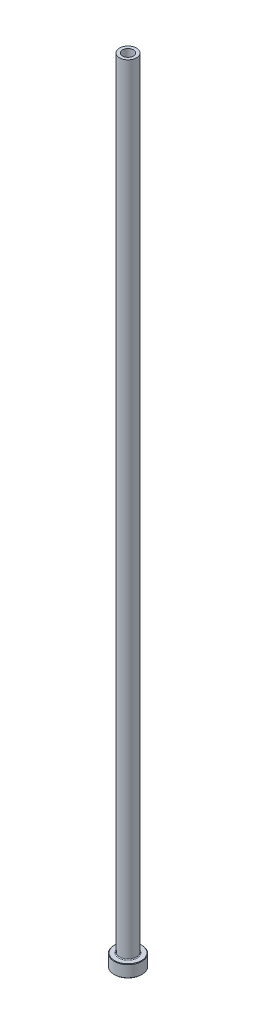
ISO-10303-21;
HEADER;
FILE_DESCRIPTION(('STEP AP214'),'2;1');
FILE_NAME('part.step','',(''),(''),'','','');
FILE_SCHEMA(('AUTOMOTIVE_DESIGN { 1 0 10303 214 1 1 1 1 }'));
ENDSEC;
DATA;
#1=APPLICATION_CONTEXT('core data for automotive mechanical design processes');
#2=APPLICATION_PROTOCOL_DEFINITION('international standard','automotive_design',2000,#1);
#3=PRODUCT_CONTEXT('',#1,'mechanical');
#4=PRODUCT('Part','Part','',(#3));
#5=PRODUCT_RELATED_PRODUCT_CATEGORY('part','',(#4));
#6=PRODUCT_DEFINITION_FORMATION('','',#4);
#7=PRODUCT_DEFINITION_CONTEXT('part definition',#1,'design');
#8=PRODUCT_DEFINITION('design','',#6,#7);
#9=PRODUCT_DEFINITION_SHAPE('','',#8);
#10=(LENGTH_UNIT() NAMED_UNIT(*) SI_UNIT(.MILLI.,.METRE.));
#11=(NAMED_UNIT(*) PLANE_ANGLE_UNIT() SI_UNIT($,.RADIAN.));
#12=(NAMED_UNIT(*) SI_UNIT($,.STERADIAN.) SOLID_ANGLE_UNIT());
#13=UNCERTAINTY_MEASURE_WITH_UNIT(LENGTH_MEASURE(1.E-05),#10,'distance_accuracy_value','');
#14=(GEOMETRIC_REPRESENTATION_CONTEXT(3) GLOBAL_UNCERTAINTY_ASSIGNED_CONTEXT((#13)) GLOBAL_UNIT_ASSIGNED_CONTEXT((#10,
#11,#12)) REPRESENTATION_CONTEXT('',''));
#15=CARTESIAN_POINT('',(0.,0.,0.));
#16=DIRECTION('',(0.,0.,1.));
#17=DIRECTION('',(1.,0.,0.));
#18=AXIS2_PLACEMENT_3D('',#15,#16,#17);
#19=CARTESIAN_POINT('',(0.,0.,0.));
#20=DIRECTION('',(0.,-1.,0.));
#21=DIRECTION('',(0.,0.,-1.));
#22=AXIS2_PLACEMENT_3D('',#19,#20,#21);
#23=PLANE('',#22);
#24=CARTESIAN_POINT('',(0.,0.,0.));
#25=DIRECTION('',(0.,-1.,0.));
#26=DIRECTION('',(0.,0.,-1.));
#27=AXIS2_PLACEMENT_3D('',#24,#25,#26);
#28=CIRCLE('',#27,6.88340000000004);
#29=CARTESIAN_POINT('',(0.,0.,-6.88340000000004));
#30=VERTEX_POINT('',#29);
#31=EDGE_CURVE('E45',#30,#30,#28,.T.);
#32=ORIENTED_EDGE('',*,*,#31,.T.);
#33=EDGE_LOOP('',(#32));
#34=FACE_BOUND('',#33,.T.);
#35=CARTESIAN_POINT('',(0.,0.,0.));
#36=DIRECTION('',(0.,-1.,0.));
#37=DIRECTION('',(0.,0.,-1.));
#38=AXIS2_PLACEMENT_3D('',#35,#36,#37);
#39=CIRCLE('',#38,3.36550000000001);
#40=CARTESIAN_POINT('',(0.,0.,-3.36550000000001));
#41=VERTEX_POINT('',#40);
#42=EDGE_CURVE('E59',#41,#41,#39,.T.);
#43=ORIENTED_EDGE('',*,*,#42,.F.);
#44=EDGE_LOOP('',(#43));
#45=FACE_BOUND('',#44,.T.);
#46=ADVANCED_FACE('F30',(#34,#45),#23,.T.);
#47=CARTESIAN_POINT('',(0.,0.,0.));
#48=DIRECTION('',(0.,-1.,0.));
#49=DIRECTION('',(0.,0.,-1.));
#50=AXIS2_PLACEMENT_3D('',#47,#48,#49);
#51=CYLINDRICAL_SURFACE('',#50,7.1374);
#52=CARTESIAN_POINT('',(0.,0.25399999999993,0.));
#53=DIRECTION('',(0.,-1.,0.));
#54=DIRECTION('',(0.,0.,-1.));
#55=AXIS2_PLACEMENT_3D('',#52,#53,#54);
#56=CIRCLE('',#55,7.1374);
#57=CARTESIAN_POINT('',(0.,0.25399999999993,-7.1374));
#58=VERTEX_POINT('',#57);
#59=EDGE_CURVE('E37',#58,#58,#56,.F.);
#60=ORIENTED_EDGE('',*,*,#59,.T.);
#61=EDGE_LOOP('',(#60));
#62=FACE_BOUND('',#61,.T.);
#63=CARTESIAN_POINT('',(0.,6.0959999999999,0.));
#64=DIRECTION('',(0.,1.,0.));
#65=DIRECTION('',(0.,0.,1.));
#66=AXIS2_PLACEMENT_3D('',#63,#64,#65);
#67=CIRCLE('',#66,7.1374);
#68=CARTESIAN_POINT('',(0.,6.0959999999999,7.1374));
#69=VERTEX_POINT('',#68);
#70=EDGE_CURVE('E41',#69,#69,#67,.F.);
#71=ORIENTED_EDGE('',*,*,#70,.T.);
#72=EDGE_LOOP('',(#71));
#73=FACE_BOUND('',#72,.T.);
#74=ADVANCED_FACE('F104',(#62,#73),#51,.T.);
#75=CARTESIAN_POINT('',(7.1374,6.35,0.));
#76=DIRECTION('',(0.,1.,0.));
#77=DIRECTION('',(0.,0.,1.));
#78=AXIS2_PLACEMENT_3D('',#75,#76,#77);
#79=PLANE('',#78);
#80=CARTESIAN_POINT('',(0.,6.35,0.));
#81=DIRECTION('',(0.,1.,0.));
#82=DIRECTION('',(0.,0.,1.));
#83=AXIS2_PLACEMENT_3D('',#80,#81,#82);
#84=CIRCLE('',#83,6.88339999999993);
#85=CARTESIAN_POINT('',(0.,6.35,6.88339999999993));
#86=VERTEX_POINT('',#85);
#87=EDGE_CURVE('E10',#86,#86,#84,.T.);
#88=ORIENTED_EDGE('',*,*,#87,.T.);
#89=EDGE_LOOP('',(#88));
#90=FACE_BOUND('',#89,.T.);
#91=CARTESIAN_POINT('',(0.,6.35,0.));
#92=DIRECTION('',(0.,-1.,0.));
#93=DIRECTION('',(0.,0.,-1.));
#94=AXIS2_PLACEMENT_3D('',#91,#92,#93);
#95=CIRCLE('',#94,4.755515);
#96=CARTESIAN_POINT('',(0.,6.35,-4.755515));
#97=VERTEX_POINT('',#96);
#98=EDGE_CURVE('E50',#97,#97,#95,.T.);
#99=ORIENTED_EDGE('',*,*,#98,.T.);
#100=EDGE_LOOP('',(#99));
#101=FACE_BOUND('',#100,.T.);
#102=ADVANCED_FACE('F110',(#90,#101),#79,.T.);
#103=CARTESIAN_POINT('',(0.,6.746875,0.));
#104=DIRECTION('',(0.,-1.,0.));
#105=DIRECTION('',(0.,0.,-1.));
#106=AXIS2_PLACEMENT_3D('',#103,#104,#105);
#107=TOROIDAL_SURFACE('',#106,4.755515,0.396875);
#108=CARTESIAN_POINT('',(0.,6.746875,0.));
#109=DIRECTION('',(0.,-1.,0.));
#110=DIRECTION('',(0.,0.,-1.));
#111=AXIS2_PLACEMENT_3D('',#108,#109,#110);
#112=CIRCLE('',#111,4.35864);
#113=CARTESIAN_POINT('',(0.,6.746875,-4.35864));
#114=VERTEX_POINT('',#113);
#115=EDGE_CURVE('E53',#114,#114,#112,.T.);
#116=ORIENTED_EDGE('',*,*,#115,.T.);
#117=EDGE_LOOP('',(#116));
#118=FACE_BOUND('',#117,.T.);
#119=ORIENTED_EDGE('',*,*,#98,.F.);
#120=EDGE_LOOP('',(#119));
#121=FACE_BOUND('',#120,.T.);
#122=ADVANCED_FACE('F140',(#118,#121),#107,.F.);
#123=CARTESIAN_POINT('',(0.,0.,0.));
#124=DIRECTION('',(0.,-1.,0.));
#125=DIRECTION('',(0.,0.,-1.));
#126=AXIS2_PLACEMENT_3D('',#123,#124,#125);
#127=CYLINDRICAL_SURFACE('',#126,4.35864);
#128=CARTESIAN_POINT('',(0.,406.4,0.));
#129=DIRECTION('',(0.,-1.,0.));
#130=DIRECTION('',(0.,0.,-1.));
#131=AXIS2_PLACEMENT_3D('',#128,#129,#130);
#132=CIRCLE('',#131,4.35864);
#133=CARTESIAN_POINT('',(0.,406.4,-4.35864));
#134=VERTEX_POINT('',#133);
#135=EDGE_CURVE('E56',#134,#134,#132,.T.);
#136=ORIENTED_EDGE('',*,*,#135,.T.);
#137=EDGE_LOOP('',(#136));
#138=FACE_BOUND('',#137,.T.);
#139=ORIENTED_EDGE('',*,*,#115,.F.);
#140=EDGE_LOOP('',(#139));
#141=FACE_BOUND('',#140,.T.);
#142=ADVANCED_FACE('F183',(#138,#141),#127,.T.);
#143=CARTESIAN_POINT('',(4.35864,406.4,0.));
#144=DIRECTION('',(0.,1.,0.));
#145=DIRECTION('',(0.,0.,1.));
#146=AXIS2_PLACEMENT_3D('',#143,#144,#145);
#147=PLANE('',#146);
#148=CARTESIAN_POINT('',(0.,406.4,0.));
#149=DIRECTION('',(0.,-1.,0.));
#150=DIRECTION('',(0.,0.,-1.));
#151=AXIS2_PLACEMENT_3D('',#148,#149,#150);
#152=CIRCLE('',#151,2.77749);
#153=CARTESIAN_POINT('',(0.,406.4,-2.77749));
#154=VERTEX_POINT('',#153);
#155=EDGE_CURVE('E71',#154,#154,#152,.T.);
#156=ORIENTED_EDGE('',*,*,#155,.T.);
#157=EDGE_LOOP('',(#156));
#158=FACE_BOUND('',#157,.T.);
#159=ORIENTED_EDGE('',*,*,#135,.F.);
#160=EDGE_LOOP('',(#159));
#161=FACE_BOUND('',#160,.T.);
#162=ADVANCED_FACE('F75',(#158,#161),#147,.T.);
#163=CARTESIAN_POINT('',(0.,0.,0.));
#164=DIRECTION('',(0.,-1.,0.));
#165=DIRECTION('',(0.,0.,-1.));
#166=AXIS2_PLACEMENT_3D('',#163,#164,#165);
#167=CONICAL_SURFACE('',#166,3.36550000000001,0.785398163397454);
#168=CARTESIAN_POINT('',(0.,0.396875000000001,0.));
#169=DIRECTION('',(0.,-1.,0.));
#170=DIRECTION('',(0.,0.,-1.));
#171=AXIS2_PLACEMENT_3D('',#168,#169,#170);
#172=CIRCLE('',#171,2.968625);
#173=CARTESIAN_POINT('',(0.,0.396875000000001,-2.968625));
#174=VERTEX_POINT('',#173);
#175=EDGE_CURVE('E62',#174,#174,#172,.T.);
#176=ORIENTED_EDGE('',*,*,#175,.F.);
#177=EDGE_LOOP('',(#176));
#178=FACE_BOUND('',#177,.T.);
#179=ORIENTED_EDGE('',*,*,#42,.T.);
#180=EDGE_LOOP('',(#179));
#181=FACE_BOUND('',#180,.T.);
#182=ADVANCED_FACE('F94',(#178,#181),#167,.F.);
#183=CARTESIAN_POINT('',(0.,0.,0.));
#184=DIRECTION('',(0.,-1.,0.));
#185=DIRECTION('',(0.,0.,-1.));
#186=AXIS2_PLACEMENT_3D('',#183,#184,#185);
#187=CYLINDRICAL_SURFACE('',#186,2.968625);
#188=CARTESIAN_POINT('',(0.,322.2625,0.));
#189=DIRECTION('',(0.,-1.,0.));
#190=DIRECTION('',(0.,0.,-1.));
#191=AXIS2_PLACEMENT_3D('',#188,#189,#190);
#192=CIRCLE('',#191,2.968625);
#193=CARTESIAN_POINT('',(0.,322.2625,-2.968625));
#194=VERTEX_POINT('',#193);
#195=EDGE_CURVE('E65',#194,#194,#192,.T.);
#196=ORIENTED_EDGE('',*,*,#195,.F.);
#197=EDGE_LOOP('',(#196));
#198=FACE_BOUND('',#197,.T.);
#199=ORIENTED_EDGE('',*,*,#175,.T.);
#200=EDGE_LOOP('',(#199));
#201=FACE_BOUND('',#200,.T.);
#202=ADVANCED_FACE('F88',(#198,#201),#187,.F.);
#203=CARTESIAN_POINT('',(0.,322.2625,0.));
#204=DIRECTION('',(0.,-1.,0.));
#205=DIRECTION('',(0.,0.,-1.));
#206=AXIS2_PLACEMENT_3D('',#203,#204,#205);
#207=CONICAL_SURFACE('',#206,2.968625,0.0133769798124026);
#208=CARTESIAN_POINT('',(0.,336.55,0.));
#209=DIRECTION('',(0.,-1.,0.));
#210=DIRECTION('',(0.,0.,-1.));
#211=AXIS2_PLACEMENT_3D('',#208,#209,#210);
#212=CIRCLE('',#211,2.77749);
#213=CARTESIAN_POINT('',(0.,336.55,-2.77749));
#214=VERTEX_POINT('',#213);
#215=EDGE_CURVE('E68',#214,#214,#212,.T.);
#216=ORIENTED_EDGE('',*,*,#215,.F.);
#217=EDGE_LOOP('',(#216));
#218=FACE_BOUND('',#217,.T.);
#219=ORIENTED_EDGE('',*,*,#195,.T.);
#220=EDGE_LOOP('',(#219));
#221=FACE_BOUND('',#220,.T.);
#222=ADVANCED_FACE('F82',(#218,#221),#207,.F.);
#223=CARTESIAN_POINT('',(0.,0.,0.));
#224=DIRECTION('',(0.,-1.,0.));
#225=DIRECTION('',(0.,0.,-1.));
#226=AXIS2_PLACEMENT_3D('',#223,#224,#225);
#227=CYLINDRICAL_SURFACE('',#226,2.77749);
#228=ORIENTED_EDGE('',*,*,#155,.F.);
#229=EDGE_LOOP('',(#228));
#230=FACE_BOUND('',#229,.T.);
#231=ORIENTED_EDGE('',*,*,#215,.T.);
#232=EDGE_LOOP('',(#231));
#233=FACE_BOUND('',#232,.T.);
#234=ADVANCED_FACE('F78',(#230,#233),#227,.F.);
#235=CARTESIAN_POINT('',(0.,0.,0.));
#236=DIRECTION('',(0.,1.,0.));
#237=DIRECTION('',(0.,0.,1.));
#238=AXIS2_PLACEMENT_3D('',#235,#236,#237);
#239=CONICAL_SURFACE('',#238,6.88340000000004,0.785398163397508);
#240=ORIENTED_EDGE('',*,*,#59,.F.);
#241=EDGE_LOOP('',(#240));
#242=FACE_BOUND('',#241,.T.);
#243=ORIENTED_EDGE('',*,*,#31,.F.);
#244=EDGE_LOOP('',(#243));
#245=FACE_BOUND('',#244,.T.);
#246=ADVANCED_FACE('F81',(#242,#245),#239,.T.);
#247=CARTESIAN_POINT('',(0.,6.0959999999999,0.));
#248=DIRECTION('',(0.,-1.,0.));
#249=DIRECTION('',(0.,0.,-1.));
#250=AXIS2_PLACEMENT_3D('',#247,#248,#249);
#251=CONICAL_SURFACE('',#250,7.1374,0.785398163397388);
#252=ORIENTED_EDGE('',*,*,#87,.F.);
#253=EDGE_LOOP('',(#252));
#254=FACE_BOUND('',#253,.T.);
#255=ORIENTED_EDGE('',*,*,#70,.F.);
#256=EDGE_LOOP('',(#255));
#257=FACE_BOUND('',#256,.T.);
#258=ADVANCED_FACE('F32',(#254,#257),#251,.T.);
#259=CLOSED_SHELL('',(#46,#74,#102,#122,#142,#162,#182,#202,#222,#234,#246,#258));
#260=MANIFOLD_SOLID_BREP('B2',#259);
#261=ADVANCED_BREP_SHAPE_REPRESENTATION('',(#18,#260),#14);
#262=SHAPE_DEFINITION_REPRESENTATION(#9,#261);
ENDSEC;
END-ISO-10303-21;
